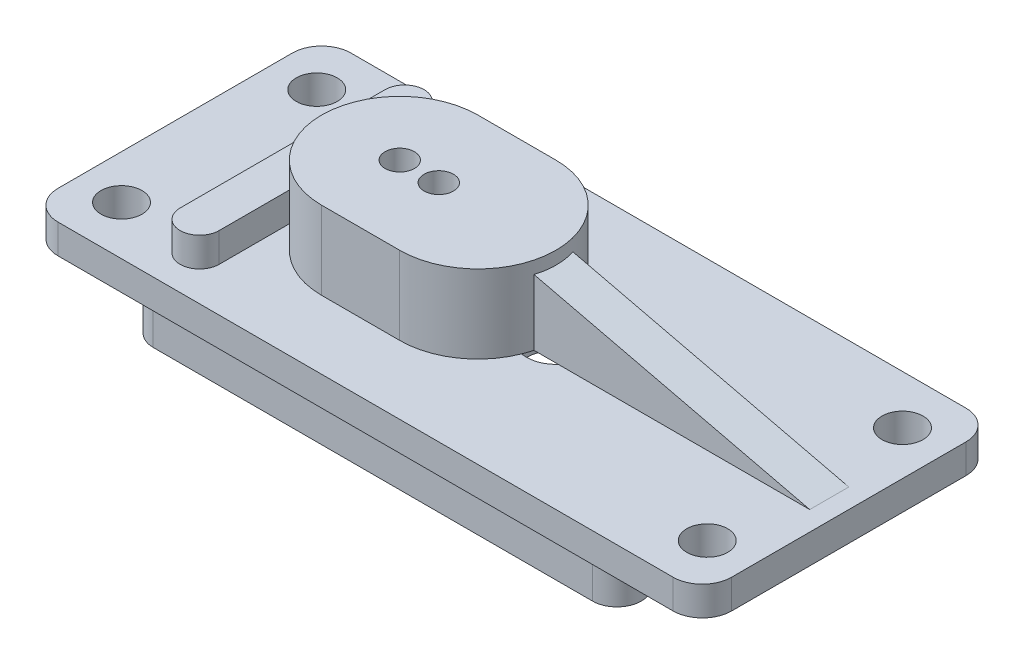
ISO-10303-21;
HEADER;
FILE_DESCRIPTION(('STEP AP214'),'2;1');
FILE_NAME('part.step','',(''),(''),'','','');
FILE_SCHEMA(('AUTOMOTIVE_DESIGN { 1 0 10303 214 1 1 1 1 }'));
ENDSEC;
DATA;
#1=APPLICATION_CONTEXT('core data for automotive mechanical design processes');
#2=APPLICATION_PROTOCOL_DEFINITION('international standard','automotive_design',2000,#1);
#3=PRODUCT_CONTEXT('',#1,'mechanical');
#4=PRODUCT('Part','Part','',(#3));
#5=PRODUCT_RELATED_PRODUCT_CATEGORY('part','',(#4));
#6=PRODUCT_DEFINITION_FORMATION('','',#4);
#7=PRODUCT_DEFINITION_CONTEXT('part definition',#1,'design');
#8=PRODUCT_DEFINITION('design','',#6,#7);
#9=PRODUCT_DEFINITION_SHAPE('','',#8);
#10=(LENGTH_UNIT() NAMED_UNIT(*) SI_UNIT(.MILLI.,.METRE.));
#11=(NAMED_UNIT(*) PLANE_ANGLE_UNIT() SI_UNIT($,.RADIAN.));
#12=(NAMED_UNIT(*) SI_UNIT($,.STERADIAN.) SOLID_ANGLE_UNIT());
#13=UNCERTAINTY_MEASURE_WITH_UNIT(LENGTH_MEASURE(1.E-05),#10,'distance_accuracy_value','');
#14=(GEOMETRIC_REPRESENTATION_CONTEXT(3) GLOBAL_UNCERTAINTY_ASSIGNED_CONTEXT((#13)) GLOBAL_UNIT_ASSIGNED_CONTEXT((#10,
#11,#12)) REPRESENTATION_CONTEXT('',''));
#15=CARTESIAN_POINT('',(0.,0.,0.));
#16=DIRECTION('',(0.,0.,1.));
#17=DIRECTION('',(1.,0.,0.));
#18=AXIS2_PLACEMENT_3D('',#15,#16,#17);
#19=CARTESIAN_POINT('',(-10.,3.,10.5));
#20=DIRECTION('',(1.,0.,0.));
#21=DIRECTION('',(0.,0.,-1.));
#22=AXIS2_PLACEMENT_3D('',#19,#20,#21);
#23=PLANE('',#22);
#24=CARTESIAN_POINT('',(-10.,3.,-10.5));
#25=CARTESIAN_POINT('',(-10.,3.,0.));
#26=B_SPLINE_CURVE_WITH_KNOTS('',1,(#24,#25),.UNSPECIFIED.,.F.,.F.,(2,2),(0.,1.),.UNSPECIFIED.);
#27=CARTESIAN_POINT('',(-10.,3.,-10.5));
#28=VERTEX_POINT('',#27);
#29=CARTESIAN_POINT('',(-10.,3.,0.));
#30=VERTEX_POINT('',#29);
#31=EDGE_CURVE('E191',#28,#30,#26,.T.);
#32=ORIENTED_EDGE('',*,*,#31,.F.);
#33=CARTESIAN_POINT('',(-10.,3.,-10.5));
#34=CARTESIAN_POINT('',(-10.,6.,-10.5));
#35=B_SPLINE_CURVE_WITH_KNOTS('',1,(#33,#34),.UNSPECIFIED.,.F.,.F.,(2,2),(0.,1.),.UNSPECIFIED.);
#36=CARTESIAN_POINT('',(-10.,6.,-10.5));
#37=VERTEX_POINT('',#36);
#38=EDGE_CURVE('E69',#28,#37,#35,.T.);
#39=ORIENTED_EDGE('',*,*,#38,.T.);
#40=CARTESIAN_POINT('',(-10.,6.,10.5));
#41=CARTESIAN_POINT('',(-10.,6.,-10.5));
#42=B_SPLINE_CURVE_WITH_KNOTS('',1,(#40,#41),.UNSPECIFIED.,.F.,.F.,(2,2),(0.,1.),.UNSPECIFIED.);
#43=CARTESIAN_POINT('',(-10.,6.,10.5));
#44=VERTEX_POINT('',#43);
#45=EDGE_CURVE('E63',#44,#37,#42,.T.);
#46=ORIENTED_EDGE('',*,*,#45,.F.);
#47=CARTESIAN_POINT('',(-10.,3.,10.5));
#48=CARTESIAN_POINT('',(-10.,6.,10.5));
#49=B_SPLINE_CURVE_WITH_KNOTS('',1,(#47,#48),.UNSPECIFIED.,.F.,.F.,(2,2),(0.,1.),.UNSPECIFIED.);
#50=CARTESIAN_POINT('',(-10.,3.,10.5));
#51=VERTEX_POINT('',#50);
#52=EDGE_CURVE('E66',#51,#44,#49,.T.);
#53=ORIENTED_EDGE('',*,*,#52,.F.);
#54=CARTESIAN_POINT('',(-10.,3.,0.));
#55=CARTESIAN_POINT('',(-10.,3.,10.5));
#56=B_SPLINE_CURVE_WITH_KNOTS('',1,(#54,#55),.UNSPECIFIED.,.F.,.F.,(2,2),(0.,1.),.UNSPECIFIED.);
#57=EDGE_CURVE('E183',#30,#51,#56,.T.);
#58=ORIENTED_EDGE('',*,*,#57,.F.);
#59=EDGE_LOOP('',(#32,#39,#46,#53,#58));
#60=FACE_BOUND('',#59,.T.);
#61=ADVANCED_FACE('F16',(#60),#23,.T.);
#62=CARTESIAN_POINT('',(0.,6.,0.));
#63=DIRECTION('',(0.,1.,0.));
#64=DIRECTION('',(0.,0.,1.));
#65=AXIS2_PLACEMENT_3D('',#62,#63,#64);
#66=PLANE('',#65);
#67=CARTESIAN_POINT('',(-12.,6.,10.5));
#68=DIRECTION('',(0.,1.,0.));
#69=DIRECTION('',(0.,0.,1.));
#70=AXIS2_PLACEMENT_3D('',#67,#68,#69);
#71=CIRCLE('',#70,2.);
#72=CARTESIAN_POINT('',(-12.,6.,12.5));
#73=VERTEX_POINT('',#72);
#74=EDGE_CURVE('E74',#44,#73,#71,.F.);
#75=ORIENTED_EDGE('',*,*,#74,.F.);
#76=ORIENTED_EDGE('',*,*,#45,.T.);
#77=CARTESIAN_POINT('',(-12.,6.,-10.5));
#78=DIRECTION('',(0.,1.,0.));
#79=DIRECTION('',(0.,0.,1.));
#80=AXIS2_PLACEMENT_3D('',#77,#78,#79);
#81=CIRCLE('',#80,2.);
#82=CARTESIAN_POINT('',(-12.,6.,-12.5));
#83=VERTEX_POINT('',#82);
#84=EDGE_CURVE('E73',#83,#37,#81,.F.);
#85=ORIENTED_EDGE('',*,*,#84,.F.);
#86=CARTESIAN_POINT('',(-12.,6.,-10.5));
#87=DIRECTION('',(0.,1.,0.));
#88=DIRECTION('',(0.,0.,1.));
#89=AXIS2_PLACEMENT_3D('',#86,#87,#88);
#90=CIRCLE('',#89,2.);
#91=CARTESIAN_POINT('',(-14.,6.,-10.5));
#92=VERTEX_POINT('',#91);
#93=EDGE_CURVE('E116',#92,#83,#90,.F.);
#94=ORIENTED_EDGE('',*,*,#93,.F.);
#95=DIRECTION('',(0.,0.,1.));
#96=VECTOR('',#95,1.);
#97=CARTESIAN_POINT('',(-14.,6.,-10.5));
#98=LINE('',#97,#96);
#99=CARTESIAN_POINT('',(-14.,6.,10.5));
#100=VERTEX_POINT('',#99);
#101=EDGE_CURVE('E651',#100,#92,#98,.F.);
#102=ORIENTED_EDGE('',*,*,#101,.F.);
#103=CARTESIAN_POINT('',(-12.,6.,10.5));
#104=DIRECTION('',(0.,1.,0.));
#105=DIRECTION('',(0.,0.,1.));
#106=AXIS2_PLACEMENT_3D('',#103,#104,#105);
#107=CIRCLE('',#106,2.);
#108=EDGE_CURVE('E82',#73,#100,#107,.F.);
#109=ORIENTED_EDGE('',*,*,#108,.F.);
#110=EDGE_LOOP('',(#75,#76,#85,#94,#102,#109));
#111=FACE_BOUND('',#110,.T.);
#112=ADVANCED_FACE('F78',(#111),#66,.T.);
#113=CARTESIAN_POINT('',(-12.,3.,10.5));
#114=DIRECTION('',(0.,1.,0.));
#115=DIRECTION('',(0.,0.,1.));
#116=AXIS2_PLACEMENT_3D('',#113,#114,#115);
#117=CYLINDRICAL_SURFACE('',#116,2.);
#118=DIRECTION('',(0.,1.,0.));
#119=VECTOR('',#118,1.);
#120=CARTESIAN_POINT('',(-14.,3.,10.5));
#121=LINE('',#120,#119);
#122=CARTESIAN_POINT('',(-14.,3.,10.5));
#123=VERTEX_POINT('',#122);
#124=EDGE_CURVE('E657',#123,#100,#121,.T.);
#125=ORIENTED_EDGE('',*,*,#124,.F.);
#126=CARTESIAN_POINT('',(-12.,3.,10.5));
#127=DIRECTION('',(0.,1.,0.));
#128=DIRECTION('',(0.,0.,1.));
#129=AXIS2_PLACEMENT_3D('',#126,#127,#128);
#130=CIRCLE('',#129,2.);
#131=CARTESIAN_POINT('',(-12.,3.,12.5));
#132=VERTEX_POINT('',#131);
#133=EDGE_CURVE('E95',#132,#123,#130,.F.);
#134=ORIENTED_EDGE('',*,*,#133,.F.);
#135=CARTESIAN_POINT('',(-12.,3.,10.5));
#136=DIRECTION('',(0.,1.,0.));
#137=DIRECTION('',(0.,0.,1.));
#138=AXIS2_PLACEMENT_3D('',#135,#136,#137);
#139=CIRCLE('',#138,2.);
#140=EDGE_CURVE('E90',#51,#132,#139,.F.);
#141=ORIENTED_EDGE('',*,*,#140,.F.);
#142=ORIENTED_EDGE('',*,*,#52,.T.);
#143=ORIENTED_EDGE('',*,*,#74,.T.);
#144=ORIENTED_EDGE('',*,*,#108,.T.);
#145=EDGE_LOOP('',(#125,#134,#141,#142,#143,#144));
#146=FACE_BOUND('',#145,.T.);
#147=ADVANCED_FACE('F87',(#146),#117,.T.);
#148=CARTESIAN_POINT('',(-12.,3.,-10.5));
#149=DIRECTION('',(0.,1.,0.));
#150=DIRECTION('',(0.,0.,1.));
#151=AXIS2_PLACEMENT_3D('',#148,#149,#150);
#152=CYLINDRICAL_SURFACE('',#151,2.);
#153=ORIENTED_EDGE('',*,*,#84,.T.);
#154=ORIENTED_EDGE('',*,*,#38,.F.);
#155=CARTESIAN_POINT('',(-12.,3.,-10.5));
#156=DIRECTION('',(0.,1.,0.));
#157=DIRECTION('',(0.,0.,1.));
#158=AXIS2_PLACEMENT_3D('',#155,#156,#157);
#159=CIRCLE('',#158,2.);
#160=CARTESIAN_POINT('',(-12.,3.,-12.5));
#161=VERTEX_POINT('',#160);
#162=EDGE_CURVE('E93',#161,#28,#159,.F.);
#163=ORIENTED_EDGE('',*,*,#162,.F.);
#164=CARTESIAN_POINT('',(-12.,3.,-10.5));
#165=DIRECTION('',(0.,1.,0.));
#166=DIRECTION('',(0.,0.,1.));
#167=AXIS2_PLACEMENT_3D('',#164,#165,#166);
#168=CIRCLE('',#167,2.);
#169=CARTESIAN_POINT('',(-14.,3.,-10.5));
#170=VERTEX_POINT('',#169);
#171=EDGE_CURVE('E242',#170,#161,#168,.F.);
#172=ORIENTED_EDGE('',*,*,#171,.F.);
#173=DIRECTION('',(0.,1.,0.));
#174=VECTOR('',#173,1.);
#175=CARTESIAN_POINT('',(-14.,3.,-10.5));
#176=LINE('',#175,#174);
#177=EDGE_CURVE('E178',#170,#92,#176,.T.);
#178=ORIENTED_EDGE('',*,*,#177,.T.);
#179=ORIENTED_EDGE('',*,*,#93,.T.);
#180=EDGE_LOOP('',(#153,#154,#163,#172,#178,#179));
#181=FACE_BOUND('',#180,.T.);
#182=ADVANCED_FACE('F648',(#181),#152,.T.);
#183=CARTESIAN_POINT('',(-2.,0.,8.));
#184=DIRECTION('',(0.,0.,1.));
#185=DIRECTION('',(1.,0.,0.));
#186=AXIS2_PLACEMENT_3D('',#183,#184,#185);
#187=PLANE('',#186);
#188=DIRECTION('',(1.,0.,0.));
#189=VECTOR('',#188,1.);
#190=CARTESIAN_POINT('',(0.,11.,8.));
#191=LINE('',#190,#189);
#192=CARTESIAN_POINT('',(-2.,11.,8.));
#193=VERTEX_POINT('',#192);
#194=CARTESIAN_POINT('',(6.,11.,8.));
#195=VERTEX_POINT('',#194);
#196=EDGE_CURVE('E174',#193,#195,#191,.T.);
#197=ORIENTED_EDGE('',*,*,#196,.F.);
#198=DIRECTION('',(0.,1.,0.));
#199=VECTOR('',#198,1.);
#200=CARTESIAN_POINT('',(-2.,0.,8.));
#201=LINE('',#200,#199);
#202=CARTESIAN_POINT('',(-2.00000000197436,3.,8.));
#203=VERTEX_POINT('',#202);
#204=EDGE_CURVE('E124',#203,#193,#201,.T.);
#205=ORIENTED_EDGE('',*,*,#204,.F.);
#206=DIRECTION('',(1.,0.,0.));
#207=VECTOR('',#206,1.);
#208=CARTESIAN_POINT('',(0.,3.,8.));
#209=LINE('',#208,#207);
#210=CARTESIAN_POINT('',(6.,3.,8.));
#211=VERTEX_POINT('',#210);
#212=EDGE_CURVE('E177',#211,#203,#209,.F.);
#213=ORIENTED_EDGE('',*,*,#212,.F.);
#214=DIRECTION('',(0.,1.,0.));
#215=VECTOR('',#214,1.);
#216=CARTESIAN_POINT('',(6.,0.,8.));
#217=LINE('',#216,#215);
#218=EDGE_CURVE('E173',#195,#211,#217,.F.);
#219=ORIENTED_EDGE('',*,*,#218,.F.);
#220=EDGE_LOOP('',(#197,#205,#213,#219));
#221=FACE_BOUND('',#220,.T.);
#222=ADVANCED_FACE('F936',(#221),#187,.T.);
#223=CARTESIAN_POINT('',(6.,0.,-8.));
#224=DIRECTION('',(0.,0.,-1.));
#225=DIRECTION('',(-1.,0.,0.));
#226=AXIS2_PLACEMENT_3D('',#223,#224,#225);
#227=PLANE('',#226);
#228=DIRECTION('',(1.,0.,0.));
#229=VECTOR('',#228,1.);
#230=CARTESIAN_POINT('',(0.,11.,-8.));
#231=LINE('',#230,#229);
#232=CARTESIAN_POINT('',(6.,11.,-8.));
#233=VERTEX_POINT('',#232);
#234=CARTESIAN_POINT('',(-2.,11.,-8.));
#235=VERTEX_POINT('',#234);
#236=EDGE_CURVE('E170',#233,#235,#231,.F.);
#237=ORIENTED_EDGE('',*,*,#236,.F.);
#238=DIRECTION('',(0.,1.,0.));
#239=VECTOR('',#238,1.);
#240=CARTESIAN_POINT('',(6.,0.,-8.));
#241=LINE('',#240,#239);
#242=CARTESIAN_POINT('',(6.,3.,-8.));
#243=VERTEX_POINT('',#242);
#244=EDGE_CURVE('E167',#243,#233,#241,.T.);
#245=ORIENTED_EDGE('',*,*,#244,.F.);
#246=DIRECTION('',(1.,0.,0.));
#247=VECTOR('',#246,1.);
#248=CARTESIAN_POINT('',(0.,3.,-8.));
#249=LINE('',#248,#247);
#250=CARTESIAN_POINT('',(-2.,3.,-8.));
#251=VERTEX_POINT('',#250);
#252=EDGE_CURVE('E159',#251,#243,#249,.T.);
#253=ORIENTED_EDGE('',*,*,#252,.F.);
#254=DIRECTION('',(0.,1.,0.));
#255=VECTOR('',#254,1.);
#256=CARTESIAN_POINT('',(-2.,0.,-8.));
#257=LINE('',#256,#255);
#258=EDGE_CURVE('E11',#251,#235,#257,.T.);
#259=ORIENTED_EDGE('',*,*,#258,.T.);
#260=EDGE_LOOP('',(#237,#245,#253,#259));
#261=FACE_BOUND('',#260,.T.);
#262=ADVANCED_FACE('F929',(#261),#227,.T.);
#263=CARTESIAN_POINT('',(0.,11.,0.));
#264=DIRECTION('',(0.,1.,0.));
#265=DIRECTION('',(0.,0.,1.));
#266=AXIS2_PLACEMENT_3D('',#263,#264,#265);
#267=PLANE('',#266);
#268=CARTESIAN_POINT('',(-2.,11.,0.));
#269=DIRECTION('',(0.,1.,0.));
#270=DIRECTION('',(0.,0.,1.));
#271=AXIS2_PLACEMENT_3D('',#268,#269,#270);
#272=CIRCLE('',#271,1.5);
#273=CARTESIAN_POINT('',(-2.,11.,1.5));
#274=VERTEX_POINT('',#273);
#275=EDGE_CURVE('E166',#274,#274,#272,.F.);
#276=ORIENTED_EDGE('',*,*,#275,.T.);
#277=EDGE_LOOP('',(#276));
#278=FACE_BOUND('',#277,.T.);
#279=CARTESIAN_POINT('',(2.,11.,0.));
#280=DIRECTION('',(0.,1.,0.));
#281=DIRECTION('',(0.,0.,1.));
#282=AXIS2_PLACEMENT_3D('',#279,#280,#281);
#283=CIRCLE('',#282,1.5);
#284=CARTESIAN_POINT('',(2.,11.,1.5));
#285=VERTEX_POINT('',#284);
#286=EDGE_CURVE('E260',#285,#285,#283,.F.);
#287=ORIENTED_EDGE('',*,*,#286,.T.);
#288=EDGE_LOOP('',(#287));
#289=FACE_BOUND('',#288,.T.);
#290=ORIENTED_EDGE('',*,*,#236,.T.);
#291=CARTESIAN_POINT('',(-2.,11.,0.));
#292=DIRECTION('',(0.,1.,0.));
#293=DIRECTION('',(0.,0.,1.));
#294=AXIS2_PLACEMENT_3D('',#291,#292,#293);
#295=CIRCLE('',#294,8.);
#296=EDGE_CURVE('E27',#235,#193,#295,.T.);
#297=ORIENTED_EDGE('',*,*,#296,.T.);
#298=ORIENTED_EDGE('',*,*,#196,.T.);
#299=CARTESIAN_POINT('',(6.,11.,0.));
#300=DIRECTION('',(0.,1.,0.));
#301=DIRECTION('',(0.,0.,1.));
#302=AXIS2_PLACEMENT_3D('',#299,#300,#301);
#303=CIRCLE('',#302,8.);
#304=EDGE_CURVE('E263',#195,#233,#303,.T.);
#305=ORIENTED_EDGE('',*,*,#304,.T.);
#306=EDGE_LOOP('',(#290,#297,#298,#305));
#307=FACE_BOUND('',#306,.T.);
#308=ADVANCED_FACE('F220',(#278,#289,#307),#267,.T.);
#309=CARTESIAN_POINT('',(0.,3.,0.));
#310=DIRECTION('',(0.,1.,0.));
#311=DIRECTION('',(0.,0.,1.));
#312=AXIS2_PLACEMENT_3D('',#309,#310,#311);
#313=PLANE('',#312);
#314=CARTESIAN_POINT('',(39.5,3.,-10.));
#315=DIRECTION('',(0.,1.,0.));
#316=DIRECTION('',(0.,0.,1.));
#317=AXIS2_PLACEMENT_3D('',#314,#315,#316);
#318=CIRCLE('',#317,2.1);
#319=CARTESIAN_POINT('',(39.5,3.,-7.9));
#320=VERTEX_POINT('',#319);
#321=EDGE_CURVE('E266',#320,#320,#318,.F.);
#322=ORIENTED_EDGE('',*,*,#321,.T.);
#323=EDGE_LOOP('',(#322));
#324=FACE_BOUND('',#323,.T.);
#325=CARTESIAN_POINT('',(39.5,3.,10.));
#326=DIRECTION('',(0.,1.,0.));
#327=DIRECTION('',(0.,0.,1.));
#328=AXIS2_PLACEMENT_3D('',#325,#326,#327);
#329=CIRCLE('',#328,2.1);
#330=CARTESIAN_POINT('',(39.5,3.,12.1));
#331=VERTEX_POINT('',#330);
#332=EDGE_CURVE('E269',#331,#331,#329,.F.);
#333=ORIENTED_EDGE('',*,*,#332,.T.);
#334=EDGE_LOOP('',(#333));
#335=FACE_BOUND('',#334,.T.);
#336=CARTESIAN_POINT('',(-20.5,3.,-10.));
#337=DIRECTION('',(0.,1.,0.));
#338=DIRECTION('',(0.,0.,1.));
#339=AXIS2_PLACEMENT_3D('',#336,#337,#338);
#340=CIRCLE('',#339,2.1);
#341=CARTESIAN_POINT('',(-20.5,3.,-7.9));
#342=VERTEX_POINT('',#341);
#343=EDGE_CURVE('E272',#342,#342,#340,.F.);
#344=ORIENTED_EDGE('',*,*,#343,.T.);
#345=EDGE_LOOP('',(#344));
#346=FACE_BOUND('',#345,.T.);
#347=CARTESIAN_POINT('',(-20.5,3.,10.));
#348=DIRECTION('',(0.,1.,0.));
#349=DIRECTION('',(0.,0.,1.));
#350=AXIS2_PLACEMENT_3D('',#347,#348,#349);
#351=CIRCLE('',#350,2.1);
#352=CARTESIAN_POINT('',(-20.5,3.,12.1));
#353=VERTEX_POINT('',#352);
#354=EDGE_CURVE('E275',#353,#353,#351,.F.);
#355=ORIENTED_EDGE('',*,*,#354,.T.);
#356=EDGE_LOOP('',(#355));
#357=FACE_BOUND('',#356,.T.);
#358=ORIENTED_EDGE('',*,*,#252,.T.);
#359=CARTESIAN_POINT('',(6.,3.,0.));
#360=DIRECTION('',(0.,1.,0.));
#361=DIRECTION('',(0.,0.,1.));
#362=AXIS2_PLACEMENT_3D('',#359,#360,#361);
#363=CIRCLE('',#362,8.);
#364=CARTESIAN_POINT('',(13.4375,3.,-2.94679380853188));
#365=VERTEX_POINT('',#364);
#366=EDGE_CURVE('E278',#243,#365,#363,.F.);
#367=ORIENTED_EDGE('',*,*,#366,.T.);
#368=CARTESIAN_POINT('',(14.,3.,0.));
#369=DIRECTION('',(0.,1.,0.));
#370=DIRECTION('',(0.,0.,1.));
#371=AXIS2_PLACEMENT_3D('',#368,#369,#370);
#372=CIRCLE('',#371,3.);
#373=CARTESIAN_POINT('',(16.2360679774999,3.,-2.));
#374=VERTEX_POINT('',#373);
#375=EDGE_CURVE('E281',#365,#374,#372,.F.);
#376=ORIENTED_EDGE('',*,*,#375,.T.);
#377=DIRECTION('',(1.,0.,0.));
#378=VECTOR('',#377,1.);
#379=CARTESIAN_POINT('',(0.,3.,-2.));
#380=LINE('',#379,#378);
#381=CARTESIAN_POINT('',(42.,3.,-2.));
#382=VERTEX_POINT('',#381);
#383=EDGE_CURVE('E284',#374,#382,#380,.T.);
#384=ORIENTED_EDGE('',*,*,#383,.T.);
#385=DIRECTION('',(0.,0.,1.));
#386=VECTOR('',#385,1.);
#387=CARTESIAN_POINT('',(42.,3.,0.));
#388=LINE('',#387,#386);
#389=CARTESIAN_POINT('',(42.,3.,2.));
#390=VERTEX_POINT('',#389);
#391=EDGE_CURVE('E287',#382,#390,#388,.T.);
#392=ORIENTED_EDGE('',*,*,#391,.T.);
#393=DIRECTION('',(1.,0.,0.));
#394=VECTOR('',#393,1.);
#395=CARTESIAN_POINT('',(0.,3.,2.));
#396=LINE('',#395,#394);
#397=CARTESIAN_POINT('',(16.2360679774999,3.,2.));
#398=VERTEX_POINT('',#397);
#399=EDGE_CURVE('E290',#390,#398,#396,.F.);
#400=ORIENTED_EDGE('',*,*,#399,.T.);
#401=CARTESIAN_POINT('',(14.,3.,0.));
#402=DIRECTION('',(0.,1.,0.));
#403=DIRECTION('',(0.,0.,1.));
#404=AXIS2_PLACEMENT_3D('',#401,#402,#403);
#405=CIRCLE('',#404,3.);
#406=CARTESIAN_POINT('',(13.4375,3.,2.94679380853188));
#407=VERTEX_POINT('',#406);
#408=EDGE_CURVE('E293',#398,#407,#405,.F.);
#409=ORIENTED_EDGE('',*,*,#408,.T.);
#410=CARTESIAN_POINT('',(6.,3.,0.));
#411=DIRECTION('',(0.,1.,0.));
#412=DIRECTION('',(0.,0.,1.));
#413=AXIS2_PLACEMENT_3D('',#410,#411,#412);
#414=CIRCLE('',#413,8.);
#415=EDGE_CURVE('E186',#407,#211,#414,.F.);
#416=ORIENTED_EDGE('',*,*,#415,.T.);
#417=ORIENTED_EDGE('',*,*,#212,.T.);
#418=CARTESIAN_POINT('',(-2.,3.,0.));
#419=DIRECTION('',(0.,1.,0.));
#420=DIRECTION('',(-1.,0.,0.));
#421=AXIS2_PLACEMENT_3D('',#418,#419,#420);
#422=CIRCLE('',#421,8.);
#423=EDGE_CURVE('E126',#30,#203,#422,.T.);
#424=ORIENTED_EDGE('',*,*,#423,.F.);
#425=ORIENTED_EDGE('',*,*,#57,.T.);
#426=ORIENTED_EDGE('',*,*,#140,.T.);
#427=ORIENTED_EDGE('',*,*,#133,.T.);
#428=DIRECTION('',(0.,0.,1.));
#429=VECTOR('',#428,1.);
#430=CARTESIAN_POINT('',(-14.,3.,0.));
#431=LINE('',#430,#429);
#432=EDGE_CURVE('E185',#123,#170,#431,.F.);
#433=ORIENTED_EDGE('',*,*,#432,.T.);
#434=ORIENTED_EDGE('',*,*,#171,.T.);
#435=ORIENTED_EDGE('',*,*,#162,.T.);
#436=ORIENTED_EDGE('',*,*,#31,.T.);
#437=CARTESIAN_POINT('',(-2.,3.,0.));
#438=DIRECTION('',(0.,1.,0.));
#439=DIRECTION('',(0.,0.,-1.));
#440=AXIS2_PLACEMENT_3D('',#437,#438,#439);
#441=CIRCLE('',#440,8.);
#442=EDGE_CURVE('E36',#251,#30,#441,.T.);
#443=ORIENTED_EDGE('',*,*,#442,.F.);
#444=EDGE_LOOP('',(#358,#367,#376,#384,#392,#400,#409,#416,#417,#424,#425,#426,#427,#433,#434,
#435,#436,#443));
#445=FACE_BOUND('',#444,.T.);
#446=CARTESIAN_POINT('',(-22.,3.,-12.));
#447=DIRECTION('',(0.,-1.,0.));
#448=DIRECTION('',(0.,0.,-1.));
#449=AXIS2_PLACEMENT_3D('',#446,#447,#448);
#450=CIRCLE('',#449,3.);
#451=CARTESIAN_POINT('',(-25.,3.,-12.));
#452=VERTEX_POINT('',#451);
#453=CARTESIAN_POINT('',(-22.,3.,-15.));
#454=VERTEX_POINT('',#453);
#455=EDGE_CURVE('E196',#452,#454,#450,.T.);
#456=ORIENTED_EDGE('',*,*,#455,.F.);
#457=DIRECTION('',(0.,0.,1.));
#458=VECTOR('',#457,1.);
#459=CARTESIAN_POINT('',(-25.,3.,-15.));
#460=LINE('',#459,#458);
#461=CARTESIAN_POINT('',(-25.,3.,12.));
#462=VERTEX_POINT('',#461);
#463=EDGE_CURVE('E301',#462,#452,#460,.F.);
#464=ORIENTED_EDGE('',*,*,#463,.F.);
#465=CARTESIAN_POINT('',(-22.,3.,12.));
#466=DIRECTION('',(0.,-1.,0.));
#467=DIRECTION('',(0.,0.,-1.));
#468=AXIS2_PLACEMENT_3D('',#465,#466,#467);
#469=CIRCLE('',#468,3.);
#470=CARTESIAN_POINT('',(-22.,3.,15.));
#471=VERTEX_POINT('',#470);
#472=EDGE_CURVE('E304',#471,#462,#469,.T.);
#473=ORIENTED_EDGE('',*,*,#472,.F.);
#474=DIRECTION('',(1.,0.,0.));
#475=VECTOR('',#474,1.);
#476=CARTESIAN_POINT('',(-25.,3.,15.));
#477=LINE('',#476,#475);
#478=CARTESIAN_POINT('',(41.,3.,15.));
#479=VERTEX_POINT('',#478);
#480=EDGE_CURVE('E307',#479,#471,#477,.F.);
#481=ORIENTED_EDGE('',*,*,#480,.F.);
#482=CARTESIAN_POINT('',(41.,3.,12.));
#483=DIRECTION('',(0.,-1.,0.));
#484=DIRECTION('',(0.,0.,-1.));
#485=AXIS2_PLACEMENT_3D('',#482,#483,#484);
#486=CIRCLE('',#485,3.);
#487=CARTESIAN_POINT('',(44.,3.,12.));
#488=VERTEX_POINT('',#487);
#489=EDGE_CURVE('E310',#488,#479,#486,.T.);
#490=ORIENTED_EDGE('',*,*,#489,.F.);
#491=DIRECTION('',(0.,0.,-1.));
#492=VECTOR('',#491,1.);
#493=CARTESIAN_POINT('',(44.,3.,15.));
#494=LINE('',#493,#492);
#495=CARTESIAN_POINT('',(44.,3.,-12.));
#496=VERTEX_POINT('',#495);
#497=EDGE_CURVE('E313',#496,#488,#494,.F.);
#498=ORIENTED_EDGE('',*,*,#497,.F.);
#499=CARTESIAN_POINT('',(41.,3.,-12.));
#500=DIRECTION('',(0.,-1.,0.));
#501=DIRECTION('',(0.,0.,-1.));
#502=AXIS2_PLACEMENT_3D('',#499,#500,#501);
#503=CIRCLE('',#502,3.);
#504=CARTESIAN_POINT('',(41.,3.,-15.));
#505=VERTEX_POINT('',#504);
#506=EDGE_CURVE('E316',#505,#496,#503,.T.);
#507=ORIENTED_EDGE('',*,*,#506,.F.);
#508=DIRECTION('',(-1.,0.,0.));
#509=VECTOR('',#508,1.);
#510=CARTESIAN_POINT('',(44.,3.,-15.));
#511=LINE('',#510,#509);
#512=EDGE_CURVE('E319',#454,#505,#511,.F.);
#513=ORIENTED_EDGE('',*,*,#512,.F.);
#514=EDGE_LOOP('',(#456,#464,#473,#481,#490,#498,#507,#513));
#515=FACE_BOUND('',#514,.T.);
#516=ADVANCED_FACE('F209',(#324,#335,#346,#357,#445,#515),#313,.T.);
#517=CARTESIAN_POINT('',(39.5,0.,-10.));
#518=DIRECTION('',(0.,1.,0.));
#519=DIRECTION('',(0.,0.,1.));
#520=AXIS2_PLACEMENT_3D('',#517,#518,#519);
#521=CYLINDRICAL_SURFACE('',#520,2.1);
#522=ORIENTED_EDGE('',*,*,#321,.F.);
#523=EDGE_LOOP('',(#522));
#524=FACE_BOUND('',#523,.T.);
#525=CARTESIAN_POINT('',(39.5,0.,-10.));
#526=DIRECTION('',(0.,1.,0.));
#527=DIRECTION('',(0.,0.,1.));
#528=AXIS2_PLACEMENT_3D('',#525,#526,#527);
#529=CIRCLE('',#528,2.1);
#530=CARTESIAN_POINT('',(39.5,0.,-7.9));
#531=VERTEX_POINT('',#530);
#532=EDGE_CURVE('E322',#531,#531,#529,.F.);
#533=ORIENTED_EDGE('',*,*,#532,.T.);
#534=EDGE_LOOP('',(#533));
#535=FACE_BOUND('',#534,.T.);
#536=ADVANCED_FACE('F219',(#524,#535),#521,.F.);
#537=CARTESIAN_POINT('',(39.5,0.,10.));
#538=DIRECTION('',(0.,1.,0.));
#539=DIRECTION('',(0.,0.,1.));
#540=AXIS2_PLACEMENT_3D('',#537,#538,#539);
#541=CYLINDRICAL_SURFACE('',#540,2.1);
#542=ORIENTED_EDGE('',*,*,#332,.F.);
#543=EDGE_LOOP('',(#542));
#544=FACE_BOUND('',#543,.T.);
#545=CARTESIAN_POINT('',(39.5,0.,10.));
#546=DIRECTION('',(0.,1.,0.));
#547=DIRECTION('',(0.,0.,1.));
#548=AXIS2_PLACEMENT_3D('',#545,#546,#547);
#549=CIRCLE('',#548,2.1);
#550=CARTESIAN_POINT('',(39.5,0.,12.1));
#551=VERTEX_POINT('',#550);
#552=EDGE_CURVE('E325',#551,#551,#549,.F.);
#553=ORIENTED_EDGE('',*,*,#552,.T.);
#554=EDGE_LOOP('',(#553));
#555=FACE_BOUND('',#554,.T.);
#556=ADVANCED_FACE('F905',(#544,#555),#541,.F.);
#557=CARTESIAN_POINT('',(-20.5,0.,-10.));
#558=DIRECTION('',(0.,1.,0.));
#559=DIRECTION('',(0.,0.,1.));
#560=AXIS2_PLACEMENT_3D('',#557,#558,#559);
#561=CYLINDRICAL_SURFACE('',#560,2.1);
#562=ORIENTED_EDGE('',*,*,#343,.F.);
#563=EDGE_LOOP('',(#562));
#564=FACE_BOUND('',#563,.T.);
#565=CARTESIAN_POINT('',(-20.5,0.,-10.));
#566=DIRECTION('',(0.,1.,0.));
#567=DIRECTION('',(0.,0.,1.));
#568=AXIS2_PLACEMENT_3D('',#565,#566,#567);
#569=CIRCLE('',#568,2.1);
#570=CARTESIAN_POINT('',(-20.5,0.,-7.9));
#571=VERTEX_POINT('',#570);
#572=EDGE_CURVE('E328',#571,#571,#569,.F.);
#573=ORIENTED_EDGE('',*,*,#572,.T.);
#574=EDGE_LOOP('',(#573));
#575=FACE_BOUND('',#574,.T.);
#576=ADVANCED_FACE('F897',(#564,#575),#561,.F.);
#577=CARTESIAN_POINT('',(-20.5,0.,10.));
#578=DIRECTION('',(0.,1.,0.));
#579=DIRECTION('',(0.,0.,1.));
#580=AXIS2_PLACEMENT_3D('',#577,#578,#579);
#581=CYLINDRICAL_SURFACE('',#580,2.1);
#582=ORIENTED_EDGE('',*,*,#354,.F.);
#583=EDGE_LOOP('',(#582));
#584=FACE_BOUND('',#583,.T.);
#585=CARTESIAN_POINT('',(-20.5,0.,10.));
#586=DIRECTION('',(0.,1.,0.));
#587=DIRECTION('',(0.,0.,1.));
#588=AXIS2_PLACEMENT_3D('',#585,#586,#587);
#589=CIRCLE('',#588,2.1);
#590=CARTESIAN_POINT('',(-20.5,0.,12.1));
#591=VERTEX_POINT('',#590);
#592=EDGE_CURVE('E331',#591,#591,#589,.F.);
#593=ORIENTED_EDGE('',*,*,#592,.T.);
#594=EDGE_LOOP('',(#593));
#595=FACE_BOUND('',#594,.T.);
#596=ADVANCED_FACE('F889',(#584,#595),#581,.F.);
#597=CARTESIAN_POINT('',(6.,0.,0.));
#598=DIRECTION('',(0.,1.,0.));
#599=DIRECTION('',(0.,0.,1.));
#600=AXIS2_PLACEMENT_3D('',#597,#598,#599);
#601=CYLINDRICAL_SURFACE('',#600,8.);
#602=ORIENTED_EDGE('',*,*,#218,.T.);
#603=ORIENTED_EDGE('',*,*,#415,.F.);
#604=CARTESIAN_POINT('',(6.,3.,0.));
#605=DIRECTION('',(0.,1.,0.));
#606=DIRECTION('',(0.,0.,1.));
#607=AXIS2_PLACEMENT_3D('',#604,#605,#606);
#608=CIRCLE('',#607,8.);
#609=CARTESIAN_POINT('',(13.7459666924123,3.,2.00000000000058));
#610=VERTEX_POINT('',#609);
#611=EDGE_CURVE('E334',#407,#610,#608,.T.);
#612=ORIENTED_EDGE('',*,*,#611,.T.);
#613=DIRECTION('',(0.,1.,0.));
#614=VECTOR('',#613,1.);
#615=CARTESIAN_POINT('',(13.7459666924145,0.,2.00000000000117));
#616=LINE('',#615,#614);
#617=CARTESIAN_POINT('',(13.7459666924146,9.72715078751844,2.00000000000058));
#618=VERTEX_POINT('',#617);
#619=EDGE_CURVE('E337',#610,#618,#616,.T.);
#620=ORIENTED_EDGE('',*,*,#619,.T.);
#621=CARTESIAN_POINT('',(6.,11.5714285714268,0.));
#622=DIRECTION('',(0.231620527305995,0.972806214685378,0.));
#623=DIRECTION('',(-0.972806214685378,0.231620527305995,0.));
#624=AXIS2_PLACEMENT_3D('',#621,#622,#623);
#625=ELLIPSE('',#624,8.22363167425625,8.);
#626=CARTESIAN_POINT('',(13.7459666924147,9.72715078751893,-2.00000000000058));
#627=VERTEX_POINT('',#626);
#628=EDGE_CURVE('E340',#618,#627,#625,.T.);
#629=ORIENTED_EDGE('',*,*,#628,.T.);
#630=DIRECTION('',(0.,1.,0.));
#631=VECTOR('',#630,1.);
#632=CARTESIAN_POINT('',(13.7459666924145,0.,-2.00000000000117));
#633=LINE('',#632,#631);
#634=CARTESIAN_POINT('',(13.7459666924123,3.,-2.00000000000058));
#635=VERTEX_POINT('',#634);
#636=EDGE_CURVE('E343',#627,#635,#633,.F.);
#637=ORIENTED_EDGE('',*,*,#636,.T.);
#638=CARTESIAN_POINT('',(6.,3.,0.));
#639=DIRECTION('',(0.,1.,0.));
#640=DIRECTION('',(0.,0.,1.));
#641=AXIS2_PLACEMENT_3D('',#638,#639,#640);
#642=CIRCLE('',#641,8.);
#643=EDGE_CURVE('E346',#635,#365,#642,.T.);
#644=ORIENTED_EDGE('',*,*,#643,.T.);
#645=ORIENTED_EDGE('',*,*,#366,.F.);
#646=ORIENTED_EDGE('',*,*,#244,.T.);
#647=ORIENTED_EDGE('',*,*,#304,.F.);
#648=EDGE_LOOP('',(#602,#603,#612,#620,#629,#637,#644,#645,#646,#647));
#649=FACE_BOUND('',#648,.T.);
#650=ADVANCED_FACE('F881',(#649),#601,.T.);
#651=CARTESIAN_POINT('',(14.,0.,0.));
#652=DIRECTION('',(0.,1.,0.));
#653=DIRECTION('',(0.,0.,1.));
#654=AXIS2_PLACEMENT_3D('',#651,#652,#653);
#655=CYLINDRICAL_SURFACE('',#654,3.);
#656=ORIENTED_EDGE('',*,*,#375,.F.);
#657=CARTESIAN_POINT('',(14.,3.,0.));
#658=DIRECTION('',(0.,1.,0.));
#659=DIRECTION('',(0.,0.,1.));
#660=AXIS2_PLACEMENT_3D('',#657,#658,#659);
#661=CIRCLE('',#660,3.);
#662=EDGE_CURVE('E349',#407,#365,#661,.F.);
#663=ORIENTED_EDGE('',*,*,#662,.F.);
#664=ORIENTED_EDGE('',*,*,#408,.F.);
#665=CARTESIAN_POINT('',(14.,3.,0.));
#666=DIRECTION('',(0.,1.,0.));
#667=DIRECTION('',(0.,0.,1.));
#668=AXIS2_PLACEMENT_3D('',#665,#666,#667);
#669=CIRCLE('',#668,3.);
#670=EDGE_CURVE('E352',#374,#398,#669,.F.);
#671=ORIENTED_EDGE('',*,*,#670,.F.);
#672=EDGE_LOOP('',(#656,#663,#664,#671));
#673=FACE_BOUND('',#672,.T.);
#674=CARTESIAN_POINT('',(14.,0.,0.));
#675=DIRECTION('',(0.,1.,0.));
#676=DIRECTION('',(0.,0.,1.));
#677=AXIS2_PLACEMENT_3D('',#674,#675,#676);
#678=CIRCLE('',#677,3.);
#679=CARTESIAN_POINT('',(14.,0.,3.));
#680=VERTEX_POINT('',#679);
#681=EDGE_CURVE('E355',#680,#680,#678,.F.);
#682=ORIENTED_EDGE('',*,*,#681,.T.);
#683=EDGE_LOOP('',(#682));
#684=FACE_BOUND('',#683,.T.);
#685=ADVANCED_FACE('F873',(#673,#684),#655,.F.);
#686=CARTESIAN_POINT('',(0.,0.,-2.));
#687=DIRECTION('',(0.,0.,1.));
#688=DIRECTION('',(1.,0.,0.));
#689=AXIS2_PLACEMENT_3D('',#686,#687,#688);
#690=PLANE('',#689);
#691=DIRECTION('',(1.,0.,0.));
#692=VECTOR('',#691,1.);
#693=CARTESIAN_POINT('',(0.,3.,-2.));
#694=LINE('',#693,#692);
#695=EDGE_CURVE('E358',#374,#635,#694,.F.);
#696=ORIENTED_EDGE('',*,*,#695,.T.);
#697=ORIENTED_EDGE('',*,*,#636,.F.);
#698=DIRECTION('',(-0.972806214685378,0.231620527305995,0.));
#699=VECTOR('',#698,1.);
#700=CARTESIAN_POINT('',(42.,3.,-2.));
#701=LINE('',#700,#699);
#702=EDGE_CURVE('E361',#382,#627,#701,.T.);
#703=ORIENTED_EDGE('',*,*,#702,.F.);
#704=ORIENTED_EDGE('',*,*,#383,.F.);
#705=EDGE_LOOP('',(#696,#697,#703,#704));
#706=FACE_BOUND('',#705,.T.);
#707=ADVANCED_FACE('F865',(#706),#690,.F.);
#708=CARTESIAN_POINT('',(42.,3.,-2.));
#709=DIRECTION('',(0.231620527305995,0.972806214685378,0.));
#710=DIRECTION('',(-0.972806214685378,0.231620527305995,0.));
#711=AXIS2_PLACEMENT_3D('',#708,#709,#710);
#712=PLANE('',#711);
#713=ORIENTED_EDGE('',*,*,#628,.F.);
#714=DIRECTION('',(-0.972806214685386,0.231620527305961,0.));
#715=VECTOR('',#714,1.);
#716=CARTESIAN_POINT('',(42.,3.,2.));
#717=LINE('',#716,#715);
#718=EDGE_CURVE('E364',#390,#618,#717,.T.);
#719=ORIENTED_EDGE('',*,*,#718,.F.);
#720=ORIENTED_EDGE('',*,*,#391,.F.);
#721=ORIENTED_EDGE('',*,*,#702,.T.);
#722=EDGE_LOOP('',(#713,#719,#720,#721));
#723=FACE_BOUND('',#722,.T.);
#724=ADVANCED_FACE('F676',(#723),#712,.T.);
#725=CARTESIAN_POINT('',(0.,0.,2.));
#726=DIRECTION('',(0.,0.,1.));
#727=DIRECTION('',(1.,0.,0.));
#728=AXIS2_PLACEMENT_3D('',#725,#726,#727);
#729=PLANE('',#728);
#730=ORIENTED_EDGE('',*,*,#718,.T.);
#731=ORIENTED_EDGE('',*,*,#619,.F.);
#732=DIRECTION('',(1.,0.,0.));
#733=VECTOR('',#732,1.);
#734=CARTESIAN_POINT('',(0.,3.,2.));
#735=LINE('',#734,#733);
#736=EDGE_CURVE('E367',#610,#398,#735,.T.);
#737=ORIENTED_EDGE('',*,*,#736,.T.);
#738=ORIENTED_EDGE('',*,*,#399,.F.);
#739=EDGE_LOOP('',(#730,#731,#737,#738));
#740=FACE_BOUND('',#739,.T.);
#741=ADVANCED_FACE('F666',(#740),#729,.T.);
#742=CARTESIAN_POINT('',(-14.,3.,-10.5));
#743=DIRECTION('',(-1.,0.,0.));
#744=DIRECTION('',(0.,0.,1.));
#745=AXIS2_PLACEMENT_3D('',#742,#743,#744);
#746=PLANE('',#745);
#747=ORIENTED_EDGE('',*,*,#101,.T.);
#748=ORIENTED_EDGE('',*,*,#177,.F.);
#749=ORIENTED_EDGE('',*,*,#432,.F.);
#750=ORIENTED_EDGE('',*,*,#124,.T.);
#751=EDGE_LOOP('',(#747,#748,#749,#750));
#752=FACE_BOUND('',#751,.T.);
#753=ADVANCED_FACE('F663',(#752),#746,.T.);
#754=CARTESIAN_POINT('',(-22.,30.554,-12.));
#755=DIRECTION('',(0.,-1.,0.));
#756=DIRECTION('',(0.,0.,-1.));
#757=AXIS2_PLACEMENT_3D('',#754,#755,#756);
#758=CYLINDRICAL_SURFACE('',#757,3.);
#759=ORIENTED_EDGE('',*,*,#455,.T.);
#760=DIRECTION('',(0.,1.,0.));
#761=VECTOR('',#760,1.);
#762=CARTESIAN_POINT('',(-22.,0.,-15.));
#763=LINE('',#762,#761);
#764=CARTESIAN_POINT('',(-22.,0.,-15.));
#765=VERTEX_POINT('',#764);
#766=EDGE_CURVE('E370',#765,#454,#763,.T.);
#767=ORIENTED_EDGE('',*,*,#766,.F.);
#768=CARTESIAN_POINT('',(-22.,0.,-12.));
#769=DIRECTION('',(0.,-1.,0.));
#770=DIRECTION('',(0.,0.,-1.));
#771=AXIS2_PLACEMENT_3D('',#768,#769,#770);
#772=CIRCLE('',#771,3.);
#773=CARTESIAN_POINT('',(-25.,0.,-12.));
#774=VERTEX_POINT('',#773);
#775=EDGE_CURVE('E373',#765,#774,#772,.F.);
#776=ORIENTED_EDGE('',*,*,#775,.T.);
#777=DIRECTION('',(0.,1.,0.));
#778=VECTOR('',#777,1.);
#779=CARTESIAN_POINT('',(-25.,0.,-12.));
#780=LINE('',#779,#778);
#781=EDGE_CURVE('E376',#452,#774,#780,.F.);
#782=ORIENTED_EDGE('',*,*,#781,.F.);
#783=EDGE_LOOP('',(#759,#767,#776,#782));
#784=FACE_BOUND('',#783,.T.);
#785=ADVANCED_FACE('F665',(#784),#758,.T.);
#786=CARTESIAN_POINT('',(-25.,0.,-15.));
#787=DIRECTION('',(-1.,0.,0.));
#788=DIRECTION('',(0.,0.,1.));
#789=AXIS2_PLACEMENT_3D('',#786,#787,#788);
#790=PLANE('',#789);
#791=ORIENTED_EDGE('',*,*,#781,.T.);
#792=DIRECTION('',(0.,0.,1.));
#793=VECTOR('',#792,1.);
#794=CARTESIAN_POINT('',(-25.,0.,0.));
#795=LINE('',#794,#793);
#796=CARTESIAN_POINT('',(-25.,0.,12.));
#797=VERTEX_POINT('',#796);
#798=EDGE_CURVE('E379',#774,#797,#795,.T.);
#799=ORIENTED_EDGE('',*,*,#798,.T.);
#800=DIRECTION('',(0.,-1.,0.));
#801=VECTOR('',#800,1.);
#802=CARTESIAN_POINT('',(-25.,30.554,12.));
#803=LINE('',#802,#801);
#804=EDGE_CURVE('E382',#462,#797,#803,.T.);
#805=ORIENTED_EDGE('',*,*,#804,.F.);
#806=ORIENTED_EDGE('',*,*,#463,.T.);
#807=EDGE_LOOP('',(#791,#799,#805,#806));
#808=FACE_BOUND('',#807,.T.);
#809=ADVANCED_FACE('F673',(#808),#790,.T.);
#810=CARTESIAN_POINT('',(-22.,30.554,12.));
#811=DIRECTION('',(0.,-1.,0.));
#812=DIRECTION('',(0.,0.,-1.));
#813=AXIS2_PLACEMENT_3D('',#810,#811,#812);
#814=CYLINDRICAL_SURFACE('',#813,3.);
#815=ORIENTED_EDGE('',*,*,#472,.T.);
#816=ORIENTED_EDGE('',*,*,#804,.T.);
#817=CARTESIAN_POINT('',(-22.,0.,12.));
#818=DIRECTION('',(0.,-1.,0.));
#819=DIRECTION('',(0.,0.,-1.));
#820=AXIS2_PLACEMENT_3D('',#817,#818,#819);
#821=CIRCLE('',#820,3.);
#822=CARTESIAN_POINT('',(-22.,0.,15.));
#823=VERTEX_POINT('',#822);
#824=EDGE_CURVE('E385',#797,#823,#821,.F.);
#825=ORIENTED_EDGE('',*,*,#824,.T.);
#826=DIRECTION('',(0.,1.,0.));
#827=VECTOR('',#826,1.);
#828=CARTESIAN_POINT('',(-22.,0.,15.));
#829=LINE('',#828,#827);
#830=EDGE_CURVE('E388',#471,#823,#829,.F.);
#831=ORIENTED_EDGE('',*,*,#830,.F.);
#832=EDGE_LOOP('',(#815,#816,#825,#831));
#833=FACE_BOUND('',#832,.T.);
#834=ADVANCED_FACE('F737',(#833),#814,.T.);
#835=CARTESIAN_POINT('',(-25.,0.,15.));
#836=DIRECTION('',(0.,0.,1.));
#837=DIRECTION('',(1.,0.,0.));
#838=AXIS2_PLACEMENT_3D('',#835,#836,#837);
#839=PLANE('',#838);
#840=DIRECTION('',(0.,-1.,0.));
#841=VECTOR('',#840,1.);
#842=CARTESIAN_POINT('',(41.,30.554,15.));
#843=LINE('',#842,#841);
#844=CARTESIAN_POINT('',(41.,0.,15.));
#845=VERTEX_POINT('',#844);
#846=EDGE_CURVE('E391',#479,#845,#843,.T.);
#847=ORIENTED_EDGE('',*,*,#846,.F.);
#848=ORIENTED_EDGE('',*,*,#480,.T.);
#849=ORIENTED_EDGE('',*,*,#830,.T.);
#850=DIRECTION('',(1.,0.,0.));
#851=VECTOR('',#850,1.);
#852=CARTESIAN_POINT('',(0.,0.,15.));
#853=LINE('',#852,#851);
#854=EDGE_CURVE('E394',#823,#845,#853,.T.);
#855=ORIENTED_EDGE('',*,*,#854,.T.);
#856=EDGE_LOOP('',(#847,#848,#849,#855));
#857=FACE_BOUND('',#856,.T.);
#858=ADVANCED_FACE('F733',(#857),#839,.T.);
#859=CARTESIAN_POINT('',(41.,30.554,12.));
#860=DIRECTION('',(0.,-1.,0.));
#861=DIRECTION('',(0.,0.,-1.));
#862=AXIS2_PLACEMENT_3D('',#859,#860,#861);
#863=CYLINDRICAL_SURFACE('',#862,3.);
#864=ORIENTED_EDGE('',*,*,#489,.T.);
#865=ORIENTED_EDGE('',*,*,#846,.T.);
#866=CARTESIAN_POINT('',(41.,0.,12.));
#867=DIRECTION('',(0.,-1.,0.));
#868=DIRECTION('',(0.,0.,-1.));
#869=AXIS2_PLACEMENT_3D('',#866,#867,#868);
#870=CIRCLE('',#869,3.);
#871=CARTESIAN_POINT('',(44.,0.,12.));
#872=VERTEX_POINT('',#871);
#873=EDGE_CURVE('E397',#845,#872,#870,.F.);
#874=ORIENTED_EDGE('',*,*,#873,.T.);
#875=DIRECTION('',(0.,1.,0.));
#876=VECTOR('',#875,1.);
#877=CARTESIAN_POINT('',(44.,0.,12.));
#878=LINE('',#877,#876);
#879=EDGE_CURVE('E400',#488,#872,#878,.F.);
#880=ORIENTED_EDGE('',*,*,#879,.F.);
#881=EDGE_LOOP('',(#864,#865,#874,#880));
#882=FACE_BOUND('',#881,.T.);
#883=ADVANCED_FACE('F729',(#882),#863,.T.);
#884=CARTESIAN_POINT('',(44.,0.,15.));
#885=DIRECTION('',(1.,0.,0.));
#886=DIRECTION('',(0.,0.,-1.));
#887=AXIS2_PLACEMENT_3D('',#884,#885,#886);
#888=PLANE('',#887);
#889=DIRECTION('',(0.,-1.,0.));
#890=VECTOR('',#889,1.);
#891=CARTESIAN_POINT('',(44.,30.554,-12.));
#892=LINE('',#891,#890);
#893=CARTESIAN_POINT('',(44.,0.,-12.));
#894=VERTEX_POINT('',#893);
#895=EDGE_CURVE('E403',#496,#894,#892,.T.);
#896=ORIENTED_EDGE('',*,*,#895,.F.);
#897=ORIENTED_EDGE('',*,*,#497,.T.);
#898=ORIENTED_EDGE('',*,*,#879,.T.);
#899=DIRECTION('',(0.,0.,1.));
#900=VECTOR('',#899,1.);
#901=CARTESIAN_POINT('',(44.,0.,0.));
#902=LINE('',#901,#900);
#903=EDGE_CURVE('E406',#872,#894,#902,.F.);
#904=ORIENTED_EDGE('',*,*,#903,.T.);
#905=EDGE_LOOP('',(#896,#897,#898,#904));
#906=FACE_BOUND('',#905,.T.);
#907=ADVANCED_FACE('F725',(#906),#888,.T.);
#908=CARTESIAN_POINT('',(41.,30.554,-12.));
#909=DIRECTION('',(0.,-1.,0.));
#910=DIRECTION('',(0.,0.,-1.));
#911=AXIS2_PLACEMENT_3D('',#908,#909,#910);
#912=CYLINDRICAL_SURFACE('',#911,3.);
#913=ORIENTED_EDGE('',*,*,#506,.T.);
#914=ORIENTED_EDGE('',*,*,#895,.T.);
#915=CARTESIAN_POINT('',(41.,0.,-12.));
#916=DIRECTION('',(0.,-1.,0.));
#917=DIRECTION('',(0.,0.,-1.));
#918=AXIS2_PLACEMENT_3D('',#915,#916,#917);
#919=CIRCLE('',#918,3.);
#920=CARTESIAN_POINT('',(41.,0.,-15.));
#921=VERTEX_POINT('',#920);
#922=EDGE_CURVE('E409',#894,#921,#919,.F.);
#923=ORIENTED_EDGE('',*,*,#922,.T.);
#924=DIRECTION('',(0.,1.,0.));
#925=VECTOR('',#924,1.);
#926=CARTESIAN_POINT('',(41.,0.,-15.));
#927=LINE('',#926,#925);
#928=EDGE_CURVE('E412',#505,#921,#927,.F.);
#929=ORIENTED_EDGE('',*,*,#928,.F.);
#930=EDGE_LOOP('',(#913,#914,#923,#929));
#931=FACE_BOUND('',#930,.T.);
#932=ADVANCED_FACE('F721',(#931),#912,.T.);
#933=CARTESIAN_POINT('',(44.,0.,-15.));
#934=DIRECTION('',(0.,0.,-1.));
#935=DIRECTION('',(-1.,0.,0.));
#936=AXIS2_PLACEMENT_3D('',#933,#934,#935);
#937=PLANE('',#936);
#938=ORIENTED_EDGE('',*,*,#766,.T.);
#939=ORIENTED_EDGE('',*,*,#512,.T.);
#940=ORIENTED_EDGE('',*,*,#928,.T.);
#941=DIRECTION('',(1.,0.,0.));
#942=VECTOR('',#941,1.);
#943=CARTESIAN_POINT('',(0.,0.,-15.));
#944=LINE('',#943,#942);
#945=EDGE_CURVE('E415',#921,#765,#944,.F.);
#946=ORIENTED_EDGE('',*,*,#945,.T.);
#947=EDGE_LOOP('',(#938,#939,#940,#946));
#948=FACE_BOUND('',#947,.T.);
#949=ADVANCED_FACE('F717',(#948),#937,.T.);
#950=CARTESIAN_POINT('',(-2.,0.,0.));
#951=DIRECTION('',(0.,1.,0.));
#952=DIRECTION('',(0.,0.,1.));
#953=AXIS2_PLACEMENT_3D('',#950,#951,#952);
#954=CYLINDRICAL_SURFACE('',#953,1.5);
#955=ORIENTED_EDGE('',*,*,#275,.F.);
#956=EDGE_LOOP('',(#955));
#957=FACE_BOUND('',#956,.T.);
#958=CARTESIAN_POINT('',(-2.,0.,0.));
#959=DIRECTION('',(0.,1.,0.));
#960=DIRECTION('',(0.,0.,1.));
#961=AXIS2_PLACEMENT_3D('',#958,#959,#960);
#962=CIRCLE('',#961,1.5);
#963=CARTESIAN_POINT('',(-2.,0.,1.5));
#964=VERTEX_POINT('',#963);
#965=EDGE_CURVE('E418',#964,#964,#962,.F.);
#966=ORIENTED_EDGE('',*,*,#965,.T.);
#967=EDGE_LOOP('',(#966));
#968=FACE_BOUND('',#967,.T.);
#969=ADVANCED_FACE('F713',(#957,#968),#954,.F.);
#970=CARTESIAN_POINT('',(2.,0.,0.));
#971=DIRECTION('',(0.,1.,0.));
#972=DIRECTION('',(0.,0.,1.));
#973=AXIS2_PLACEMENT_3D('',#970,#971,#972);
#974=CYLINDRICAL_SURFACE('',#973,1.5);
#975=ORIENTED_EDGE('',*,*,#286,.F.);
#976=EDGE_LOOP('',(#975));
#977=FACE_BOUND('',#976,.T.);
#978=CARTESIAN_POINT('',(2.,0.,0.));
#979=DIRECTION('',(0.,1.,0.));
#980=DIRECTION('',(0.,0.,1.));
#981=AXIS2_PLACEMENT_3D('',#978,#979,#980);
#982=CIRCLE('',#981,1.5);
#983=CARTESIAN_POINT('',(2.,0.,1.5));
#984=VERTEX_POINT('',#983);
#985=EDGE_CURVE('E421',#984,#984,#982,.F.);
#986=ORIENTED_EDGE('',*,*,#985,.T.);
#987=EDGE_LOOP('',(#986));
#988=FACE_BOUND('',#987,.T.);
#989=ADVANCED_FACE('F709',(#977,#988),#974,.F.);
#990=CARTESIAN_POINT('',(0.,3.,0.));
#991=DIRECTION('',(0.,1.,0.));
#992=DIRECTION('',(0.,0.,1.));
#993=AXIS2_PLACEMENT_3D('',#990,#991,#992);
#994=PLANE('',#993);
#995=ORIENTED_EDGE('',*,*,#695,.F.);
#996=ORIENTED_EDGE('',*,*,#670,.T.);
#997=ORIENTED_EDGE('',*,*,#736,.F.);
#998=ORIENTED_EDGE('',*,*,#611,.F.);
#999=ORIENTED_EDGE('',*,*,#662,.T.);
#1000=ORIENTED_EDGE('',*,*,#643,.F.);
#1001=EDGE_LOOP('',(#995,#996,#997,#998,#999,#1000));
#1002=FACE_BOUND('',#1001,.T.);
#1003=ADVANCED_FACE('F706',(#1002),#994,.F.);
#1004=CARTESIAN_POINT('',(0.,-4.,0.));
#1005=DIRECTION('',(0.,1.,0.));
#1006=DIRECTION('',(0.,0.,1.));
#1007=AXIS2_PLACEMENT_3D('',#1004,#1005,#1006);
#1008=PLANE('',#1007);
#1009=CARTESIAN_POINT('',(32.,-4.,11.75));
#1010=DIRECTION('',(0.,1.,0.));
#1011=DIRECTION('',(0.,0.,1.));
#1012=AXIS2_PLACEMENT_3D('',#1009,#1010,#1011);
#1013=CIRCLE('',#1012,2.5);
#1014=CARTESIAN_POINT('',(32.,-4.,14.25));
#1015=VERTEX_POINT('',#1014);
#1016=CARTESIAN_POINT('',(32.,-4.,9.25));
#1017=VERTEX_POINT('',#1016);
#1018=EDGE_CURVE('E424',#1015,#1017,#1013,.T.);
#1019=ORIENTED_EDGE('',*,*,#1018,.F.);
#1020=DIRECTION('',(1.,0.,0.));
#1021=VECTOR('',#1020,1.);
#1022=CARTESIAN_POINT('',(-13.,-4.,14.25));
#1023=LINE('',#1022,#1021);
#1024=CARTESIAN_POINT('',(-13.,-4.,14.25));
#1025=VERTEX_POINT('',#1024);
#1026=EDGE_CURVE('E427',#1025,#1015,#1023,.T.);
#1027=ORIENTED_EDGE('',*,*,#1026,.F.);
#1028=CARTESIAN_POINT('',(-13.,-4.,11.75));
#1029=DIRECTION('',(0.,1.,0.));
#1030=DIRECTION('',(0.,0.,1.));
#1031=AXIS2_PLACEMENT_3D('',#1028,#1029,#1030);
#1032=CIRCLE('',#1031,2.5);
#1033=CARTESIAN_POINT('',(-13.,-4.,9.25));
#1034=VERTEX_POINT('',#1033);
#1035=EDGE_CURVE('E430',#1034,#1025,#1032,.T.);
#1036=ORIENTED_EDGE('',*,*,#1035,.F.);
#1037=DIRECTION('',(-1.,0.,0.));
#1038=VECTOR('',#1037,1.);
#1039=CARTESIAN_POINT('',(32.,-4.,9.25));
#1040=LINE('',#1039,#1038);
#1041=EDGE_CURVE('E433',#1017,#1034,#1040,.T.);
#1042=ORIENTED_EDGE('',*,*,#1041,.F.);
#1043=EDGE_LOOP('',(#1019,#1027,#1036,#1042));
#1044=FACE_BOUND('',#1043,.T.);
#1045=ADVANCED_FACE('F557',(#1044),#1008,.F.);
#1046=CARTESIAN_POINT('',(0.,-4.,0.));
#1047=DIRECTION('',(0.,1.,0.));
#1048=DIRECTION('',(0.,0.,1.));
#1049=AXIS2_PLACEMENT_3D('',#1046,#1047,#1048);
#1050=PLANE('',#1049);
#1051=CARTESIAN_POINT('',(32.,-4.,-11.75));
#1052=DIRECTION('',(0.,1.,0.));
#1053=DIRECTION('',(0.,0.,1.));
#1054=AXIS2_PLACEMENT_3D('',#1051,#1052,#1053);
#1055=CIRCLE('',#1054,2.5);
#1056=CARTESIAN_POINT('',(32.,-4.,-9.25));
#1057=VERTEX_POINT('',#1056);
#1058=CARTESIAN_POINT('',(32.,-4.,-14.25));
#1059=VERTEX_POINT('',#1058);
#1060=EDGE_CURVE('E436',#1057,#1059,#1055,.T.);
#1061=ORIENTED_EDGE('',*,*,#1060,.F.);
#1062=DIRECTION('',(1.,0.,0.));
#1063=VECTOR('',#1062,1.);
#1064=CARTESIAN_POINT('',(-13.,-4.,-9.25));
#1065=LINE('',#1064,#1063);
#1066=CARTESIAN_POINT('',(-13.,-4.,-9.25));
#1067=VERTEX_POINT('',#1066);
#1068=EDGE_CURVE('E439',#1067,#1057,#1065,.T.);
#1069=ORIENTED_EDGE('',*,*,#1068,.F.);
#1070=CARTESIAN_POINT('',(-13.,-4.,-11.75));
#1071=DIRECTION('',(0.,1.,0.));
#1072=DIRECTION('',(0.,0.,1.));
#1073=AXIS2_PLACEMENT_3D('',#1070,#1071,#1072);
#1074=CIRCLE('',#1073,2.5);
#1075=CARTESIAN_POINT('',(-13.,-4.,-14.25));
#1076=VERTEX_POINT('',#1075);
#1077=EDGE_CURVE('E442',#1076,#1067,#1074,.T.);
#1078=ORIENTED_EDGE('',*,*,#1077,.F.);
#1079=DIRECTION('',(-1.,0.,0.));
#1080=VECTOR('',#1079,1.);
#1081=CARTESIAN_POINT('',(32.,-4.,-14.25));
#1082=LINE('',#1081,#1080);
#1083=EDGE_CURVE('E445',#1059,#1076,#1082,.T.);
#1084=ORIENTED_EDGE('',*,*,#1083,.F.);
#1085=EDGE_LOOP('',(#1061,#1069,#1078,#1084));
#1086=FACE_BOUND('',#1085,.T.);
#1087=ADVANCED_FACE('F519',(#1086),#1050,.F.);
#1088=CARTESIAN_POINT('',(32.,0.,9.25));
#1089=DIRECTION('',(0.,0.,-1.));
#1090=DIRECTION('',(-1.,0.,0.));
#1091=AXIS2_PLACEMENT_3D('',#1088,#1089,#1090);
#1092=PLANE('',#1091);
#1093=ORIENTED_EDGE('',*,*,#1041,.T.);
#1094=DIRECTION('',(0.,1.,0.));
#1095=VECTOR('',#1094,1.);
#1096=CARTESIAN_POINT('',(-13.,0.,9.25));
#1097=LINE('',#1096,#1095);
#1098=CARTESIAN_POINT('',(-13.,0.,9.25));
#1099=VERTEX_POINT('',#1098);
#1100=EDGE_CURVE('E448',#1099,#1034,#1097,.F.);
#1101=ORIENTED_EDGE('',*,*,#1100,.F.);
#1102=DIRECTION('',(1.,0.,0.));
#1103=VECTOR('',#1102,1.);
#1104=CARTESIAN_POINT('',(0.,0.,9.25));
#1105=LINE('',#1104,#1103);
#1106=CARTESIAN_POINT('',(32.,0.,9.25));
#1107=VERTEX_POINT('',#1106);
#1108=EDGE_CURVE('E451',#1099,#1107,#1105,.T.);
#1109=ORIENTED_EDGE('',*,*,#1108,.T.);
#1110=DIRECTION('',(0.,1.,0.));
#1111=VECTOR('',#1110,1.);
#1112=CARTESIAN_POINT('',(32.,0.,9.25));
#1113=LINE('',#1112,#1111);
#1114=EDGE_CURVE('E454',#1017,#1107,#1113,.T.);
#1115=ORIENTED_EDGE('',*,*,#1114,.F.);
#1116=EDGE_LOOP('',(#1093,#1101,#1109,#1115));
#1117=FACE_BOUND('',#1116,.T.);
#1118=ADVANCED_FACE('F546',(#1117),#1092,.T.);
#1119=CARTESIAN_POINT('',(32.,0.,11.75));
#1120=DIRECTION('',(0.,1.,0.));
#1121=DIRECTION('',(0.,0.,1.));
#1122=AXIS2_PLACEMENT_3D('',#1119,#1120,#1121);
#1123=CYLINDRICAL_SURFACE('',#1122,2.5);
#1124=ORIENTED_EDGE('',*,*,#1114,.T.);
#1125=CARTESIAN_POINT('',(32.,0.,11.75));
#1126=DIRECTION('',(0.,1.,0.));
#1127=DIRECTION('',(0.,0.,1.));
#1128=AXIS2_PLACEMENT_3D('',#1125,#1126,#1127);
#1129=CIRCLE('',#1128,2.5);
#1130=CARTESIAN_POINT('',(32.,0.,14.25));
#1131=VERTEX_POINT('',#1130);
#1132=EDGE_CURVE('E457',#1107,#1131,#1129,.F.);
#1133=ORIENTED_EDGE('',*,*,#1132,.T.);
#1134=DIRECTION('',(0.,1.,0.));
#1135=VECTOR('',#1134,1.);
#1136=CARTESIAN_POINT('',(32.,0.,14.25));
#1137=LINE('',#1136,#1135);
#1138=EDGE_CURVE('E460',#1015,#1131,#1137,.T.);
#1139=ORIENTED_EDGE('',*,*,#1138,.F.);
#1140=ORIENTED_EDGE('',*,*,#1018,.T.);
#1141=EDGE_LOOP('',(#1124,#1133,#1139,#1140));
#1142=FACE_BOUND('',#1141,.T.);
#1143=ADVANCED_FACE('F549',(#1142),#1123,.T.);
#1144=CARTESIAN_POINT('',(-13.,0.,14.25));
#1145=DIRECTION('',(0.,0.,1.));
#1146=DIRECTION('',(1.,0.,0.));
#1147=AXIS2_PLACEMENT_3D('',#1144,#1145,#1146);
#1148=PLANE('',#1147);
#1149=ORIENTED_EDGE('',*,*,#1026,.T.);
#1150=ORIENTED_EDGE('',*,*,#1138,.T.);
#1151=DIRECTION('',(1.,0.,0.));
#1152=VECTOR('',#1151,1.);
#1153=CARTESIAN_POINT('',(0.,0.,14.25));
#1154=LINE('',#1153,#1152);
#1155=CARTESIAN_POINT('',(-13.,0.,14.25));
#1156=VERTEX_POINT('',#1155);
#1157=EDGE_CURVE('E463',#1131,#1156,#1154,.F.);
#1158=ORIENTED_EDGE('',*,*,#1157,.T.);
#1159=DIRECTION('',(0.,1.,0.));
#1160=VECTOR('',#1159,1.);
#1161=CARTESIAN_POINT('',(-13.,0.,14.25));
#1162=LINE('',#1161,#1160);
#1163=EDGE_CURVE('E466',#1025,#1156,#1162,.T.);
#1164=ORIENTED_EDGE('',*,*,#1163,.F.);
#1165=EDGE_LOOP('',(#1149,#1150,#1158,#1164));
#1166=FACE_BOUND('',#1165,.T.);
#1167=ADVANCED_FACE('F534',(#1166),#1148,.T.);
#1168=CARTESIAN_POINT('',(-13.,0.,11.75));
#1169=DIRECTION('',(0.,1.,0.));
#1170=DIRECTION('',(0.,0.,1.));
#1171=AXIS2_PLACEMENT_3D('',#1168,#1169,#1170);
#1172=CYLINDRICAL_SURFACE('',#1171,2.5);
#1173=ORIENTED_EDGE('',*,*,#1163,.T.);
#1174=CARTESIAN_POINT('',(-13.,0.,11.75));
#1175=DIRECTION('',(0.,1.,0.));
#1176=DIRECTION('',(0.,0.,1.));
#1177=AXIS2_PLACEMENT_3D('',#1174,#1175,#1176);
#1178=CIRCLE('',#1177,2.5);
#1179=EDGE_CURVE('E469',#1156,#1099,#1178,.F.);
#1180=ORIENTED_EDGE('',*,*,#1179,.T.);
#1181=ORIENTED_EDGE('',*,*,#1100,.T.);
#1182=ORIENTED_EDGE('',*,*,#1035,.T.);
#1183=EDGE_LOOP('',(#1173,#1180,#1181,#1182));
#1184=FACE_BOUND('',#1183,.T.);
#1185=ADVANCED_FACE('F540',(#1184),#1172,.T.);
#1186=CARTESIAN_POINT('',(32.,0.,-14.25));
#1187=DIRECTION('',(0.,0.,-1.));
#1188=DIRECTION('',(-1.,0.,0.));
#1189=AXIS2_PLACEMENT_3D('',#1186,#1187,#1188);
#1190=PLANE('',#1189);
#1191=ORIENTED_EDGE('',*,*,#1083,.T.);
#1192=DIRECTION('',(0.,1.,0.));
#1193=VECTOR('',#1192,1.);
#1194=CARTESIAN_POINT('',(-13.,0.,-14.25));
#1195=LINE('',#1194,#1193);
#1196=CARTESIAN_POINT('',(-13.,0.,-14.25));
#1197=VERTEX_POINT('',#1196);
#1198=EDGE_CURVE('E472',#1197,#1076,#1195,.F.);
#1199=ORIENTED_EDGE('',*,*,#1198,.F.);
#1200=DIRECTION('',(1.,0.,0.));
#1201=VECTOR('',#1200,1.);
#1202=CARTESIAN_POINT('',(0.,0.,-14.25));
#1203=LINE('',#1202,#1201);
#1204=CARTESIAN_POINT('',(32.,0.,-14.25));
#1205=VERTEX_POINT('',#1204);
#1206=EDGE_CURVE('E474',#1197,#1205,#1203,.T.);
#1207=ORIENTED_EDGE('',*,*,#1206,.T.);
#1208=DIRECTION('',(0.,1.,0.));
#1209=VECTOR('',#1208,1.);
#1210=CARTESIAN_POINT('',(32.,0.,-14.25));
#1211=LINE('',#1210,#1209);
#1212=EDGE_CURVE('E477',#1059,#1205,#1211,.T.);
#1213=ORIENTED_EDGE('',*,*,#1212,.F.);
#1214=EDGE_LOOP('',(#1191,#1199,#1207,#1213));
#1215=FACE_BOUND('',#1214,.T.);
#1216=ADVANCED_FACE('F506',(#1215),#1190,.T.);
#1217=CARTESIAN_POINT('',(32.,0.,-11.75));
#1218=DIRECTION('',(0.,1.,0.));
#1219=DIRECTION('',(0.,0.,1.));
#1220=AXIS2_PLACEMENT_3D('',#1217,#1218,#1219);
#1221=CYLINDRICAL_SURFACE('',#1220,2.5);
#1222=ORIENTED_EDGE('',*,*,#1212,.T.);
#1223=CARTESIAN_POINT('',(32.,0.,-11.75));
#1224=DIRECTION('',(0.,1.,0.));
#1225=DIRECTION('',(0.,0.,1.));
#1226=AXIS2_PLACEMENT_3D('',#1223,#1224,#1225);
#1227=CIRCLE('',#1226,2.5);
#1228=CARTESIAN_POINT('',(32.,0.,-9.25));
#1229=VERTEX_POINT('',#1228);
#1230=EDGE_CURVE('E480',#1205,#1229,#1227,.F.);
#1231=ORIENTED_EDGE('',*,*,#1230,.T.);
#1232=DIRECTION('',(0.,1.,0.));
#1233=VECTOR('',#1232,1.);
#1234=CARTESIAN_POINT('',(32.,0.,-9.25));
#1235=LINE('',#1234,#1233);
#1236=EDGE_CURVE('E483',#1057,#1229,#1235,.T.);
#1237=ORIENTED_EDGE('',*,*,#1236,.F.);
#1238=ORIENTED_EDGE('',*,*,#1060,.T.);
#1239=EDGE_LOOP('',(#1222,#1231,#1237,#1238));
#1240=FACE_BOUND('',#1239,.T.);
#1241=ADVANCED_FACE('F510',(#1240),#1221,.T.);
#1242=CARTESIAN_POINT('',(-13.,0.,-9.25));
#1243=DIRECTION('',(0.,0.,1.));
#1244=DIRECTION('',(1.,0.,0.));
#1245=AXIS2_PLACEMENT_3D('',#1242,#1243,#1244);
#1246=PLANE('',#1245);
#1247=ORIENTED_EDGE('',*,*,#1068,.T.);
#1248=ORIENTED_EDGE('',*,*,#1236,.T.);
#1249=DIRECTION('',(1.,0.,0.));
#1250=VECTOR('',#1249,1.);
#1251=CARTESIAN_POINT('',(0.,0.,-9.25));
#1252=LINE('',#1251,#1250);
#1253=CARTESIAN_POINT('',(-13.,0.,-9.25));
#1254=VERTEX_POINT('',#1253);
#1255=EDGE_CURVE('E144',#1229,#1254,#1252,.F.);
#1256=ORIENTED_EDGE('',*,*,#1255,.T.);
#1257=DIRECTION('',(0.,1.,0.));
#1258=VECTOR('',#1257,1.);
#1259=CARTESIAN_POINT('',(-13.,0.,-9.25));
#1260=LINE('',#1259,#1258);
#1261=EDGE_CURVE('E137',#1067,#1254,#1260,.T.);
#1262=ORIENTED_EDGE('',*,*,#1261,.F.);
#1263=EDGE_LOOP('',(#1247,#1248,#1256,#1262));
#1264=FACE_BOUND('',#1263,.T.);
#1265=ADVANCED_FACE('F489',(#1264),#1246,.T.);
#1266=CARTESIAN_POINT('',(-13.,0.,-11.75));
#1267=DIRECTION('',(0.,1.,0.));
#1268=DIRECTION('',(0.,0.,1.));
#1269=AXIS2_PLACEMENT_3D('',#1266,#1267,#1268);
#1270=CYLINDRICAL_SURFACE('',#1269,2.5);
#1271=ORIENTED_EDGE('',*,*,#1261,.T.);
#1272=CARTESIAN_POINT('',(-13.,0.,-11.75));
#1273=DIRECTION('',(0.,1.,0.));
#1274=DIRECTION('',(0.,0.,1.));
#1275=AXIS2_PLACEMENT_3D('',#1272,#1273,#1274);
#1276=CIRCLE('',#1275,2.5);
#1277=EDGE_CURVE('E133',#1254,#1197,#1276,.F.);
#1278=ORIENTED_EDGE('',*,*,#1277,.T.);
#1279=ORIENTED_EDGE('',*,*,#1198,.T.);
#1280=ORIENTED_EDGE('',*,*,#1077,.T.);
#1281=EDGE_LOOP('',(#1271,#1278,#1279,#1280));
#1282=FACE_BOUND('',#1281,.T.);
#1283=ADVANCED_FACE('F495',(#1282),#1270,.T.);
#1284=CARTESIAN_POINT('',(0.,0.,0.));
#1285=DIRECTION('',(0.,1.,0.));
#1286=DIRECTION('',(0.,0.,1.));
#1287=AXIS2_PLACEMENT_3D('',#1284,#1285,#1286);
#1288=PLANE('',#1287);
#1289=ORIENTED_EDGE('',*,*,#1255,.F.);
#1290=ORIENTED_EDGE('',*,*,#1230,.F.);
#1291=ORIENTED_EDGE('',*,*,#1206,.F.);
#1292=ORIENTED_EDGE('',*,*,#1277,.F.);
#1293=EDGE_LOOP('',(#1289,#1290,#1291,#1292));
#1294=FACE_BOUND('',#1293,.T.);
#1295=ORIENTED_EDGE('',*,*,#1157,.F.);
#1296=ORIENTED_EDGE('',*,*,#1132,.F.);
#1297=ORIENTED_EDGE('',*,*,#1108,.F.);
#1298=ORIENTED_EDGE('',*,*,#1179,.F.);
#1299=EDGE_LOOP('',(#1295,#1296,#1297,#1298));
#1300=FACE_BOUND('',#1299,.T.);
#1301=ORIENTED_EDGE('',*,*,#532,.F.);
#1302=EDGE_LOOP('',(#1301));
#1303=FACE_BOUND('',#1302,.T.);
#1304=ORIENTED_EDGE('',*,*,#552,.F.);
#1305=EDGE_LOOP('',(#1304));
#1306=FACE_BOUND('',#1305,.T.);
#1307=ORIENTED_EDGE('',*,*,#572,.F.);
#1308=EDGE_LOOP('',(#1307));
#1309=FACE_BOUND('',#1308,.T.);
#1310=ORIENTED_EDGE('',*,*,#592,.F.);
#1311=EDGE_LOOP('',(#1310));
#1312=FACE_BOUND('',#1311,.T.);
#1313=ORIENTED_EDGE('',*,*,#965,.F.);
#1314=EDGE_LOOP('',(#1313));
#1315=FACE_BOUND('',#1314,.T.);
#1316=ORIENTED_EDGE('',*,*,#985,.F.);
#1317=EDGE_LOOP('',(#1316));
#1318=FACE_BOUND('',#1317,.T.);
#1319=ORIENTED_EDGE('',*,*,#681,.F.);
#1320=EDGE_LOOP('',(#1319));
#1321=FACE_BOUND('',#1320,.T.);
#1322=ORIENTED_EDGE('',*,*,#922,.F.);
#1323=ORIENTED_EDGE('',*,*,#903,.F.);
#1324=ORIENTED_EDGE('',*,*,#873,.F.);
#1325=ORIENTED_EDGE('',*,*,#854,.F.);
#1326=ORIENTED_EDGE('',*,*,#824,.F.);
#1327=ORIENTED_EDGE('',*,*,#798,.F.);
#1328=ORIENTED_EDGE('',*,*,#775,.F.);
#1329=ORIENTED_EDGE('',*,*,#945,.F.);
#1330=EDGE_LOOP('',(#1322,#1323,#1324,#1325,#1326,#1327,#1328,#1329));
#1331=FACE_BOUND('',#1330,.T.);
#1332=ADVANCED_FACE('F498',(#1294,#1300,#1303,#1306,#1309,#1312,#1315,#1318,#1321,#1331),#1288,.F.);
#1333=CARTESIAN_POINT('',(-2.,0.,0.));
#1334=DIRECTION('',(0.,1.,0.));
#1335=DIRECTION('',(0.,0.,1.));
#1336=AXIS2_PLACEMENT_3D('',#1333,#1334,#1335);
#1337=CYLINDRICAL_SURFACE('',#1336,8.);
#1338=ORIENTED_EDGE('',*,*,#442,.T.);
#1339=ORIENTED_EDGE('',*,*,#423,.T.);
#1340=ORIENTED_EDGE('',*,*,#204,.T.);
#1341=ORIENTED_EDGE('',*,*,#296,.F.);
#1342=ORIENTED_EDGE('',*,*,#258,.F.);
#1343=EDGE_LOOP('',(#1338,#1339,#1340,#1341,#1342));
#1344=FACE_BOUND('',#1343,.T.);
#1345=ADVANCED_FACE('F18',(#1344),#1337,.T.);
#1346=CLOSED_SHELL('',(#61,#112,#147,#182,#222,#262,#308,#516,#536,#556,#576,#596,#650,#685,
#707,#724,#741,#753,#785,#809,#834,#858,#883,#907,#932,#949,#969,#989,#1003,#1045,#1087,#1118,
#1143,#1167,#1185,#1216,#1241,#1265,#1283,#1332,#1345));
#1347=MANIFOLD_SOLID_BREP('B1',#1346);
#1348=ADVANCED_BREP_SHAPE_REPRESENTATION('',(#18,#1347),#14);
#1349=SHAPE_DEFINITION_REPRESENTATION(#9,#1348);
ENDSEC;
END-ISO-10303-21;
